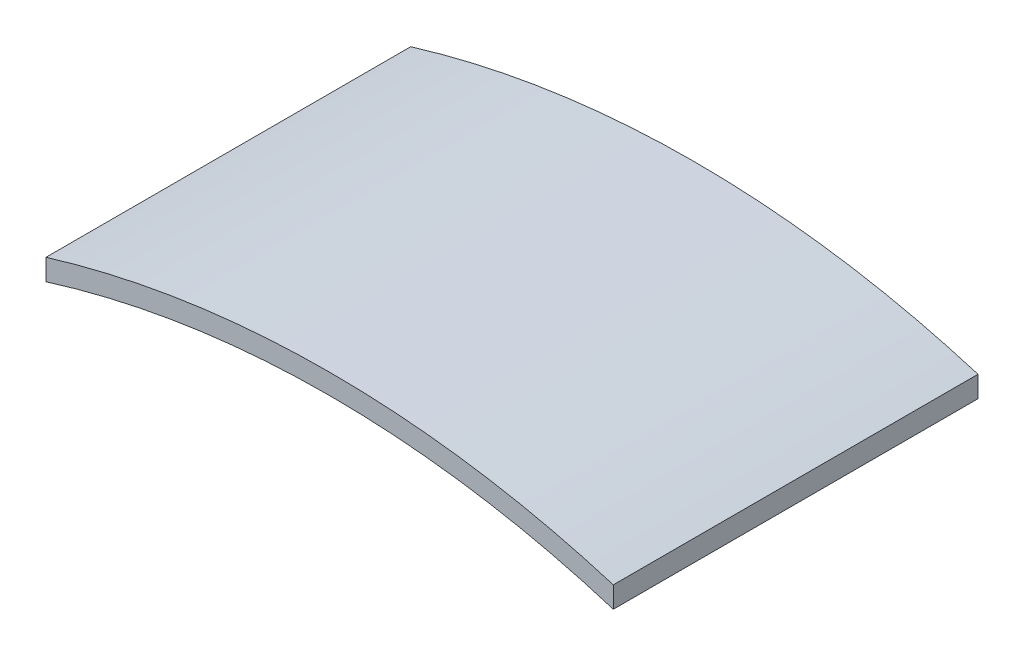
ISO-10303-21;
HEADER;
FILE_DESCRIPTION(('STEP AP214'),'2;1');
FILE_NAME('part.step','',(''),(''),'','','');
FILE_SCHEMA(('AUTOMOTIVE_DESIGN { 1 0 10303 214 1 1 1 1 }'));
ENDSEC;
DATA;
#1=APPLICATION_CONTEXT('core data for automotive mechanical design processes');
#2=APPLICATION_PROTOCOL_DEFINITION('international standard','automotive_design',2000,#1);
#3=PRODUCT_CONTEXT('',#1,'mechanical');
#4=PRODUCT('Part','Part','',(#3));
#5=PRODUCT_RELATED_PRODUCT_CATEGORY('part','',(#4));
#6=PRODUCT_DEFINITION_FORMATION('','',#4);
#7=PRODUCT_DEFINITION_CONTEXT('part definition',#1,'design');
#8=PRODUCT_DEFINITION('design','',#6,#7);
#9=PRODUCT_DEFINITION_SHAPE('','',#8);
#10=(LENGTH_UNIT() NAMED_UNIT(*) SI_UNIT(.MILLI.,.METRE.));
#11=(NAMED_UNIT(*) PLANE_ANGLE_UNIT() SI_UNIT($,.RADIAN.));
#12=(NAMED_UNIT(*) SI_UNIT($,.STERADIAN.) SOLID_ANGLE_UNIT());
#13=UNCERTAINTY_MEASURE_WITH_UNIT(LENGTH_MEASURE(1.E-05),#10,'distance_accuracy_value','');
#14=(GEOMETRIC_REPRESENTATION_CONTEXT(3) GLOBAL_UNCERTAINTY_ASSIGNED_CONTEXT((#13)) GLOBAL_UNIT_ASSIGNED_CONTEXT((#10,
#11,#12)) REPRESENTATION_CONTEXT('',''));
#15=CARTESIAN_POINT('',(0.,0.,0.));
#16=DIRECTION('',(0.,0.,1.));
#17=DIRECTION('',(1.,0.,0.));
#18=AXIS2_PLACEMENT_3D('',#15,#16,#17);
#19=CARTESIAN_POINT('',(0.,0.,28.575));
#20=DIRECTION('',(0.,0.,-1.));
#21=DIRECTION('',(-1.,0.,0.));
#22=AXIS2_PLACEMENT_3D('',#19,#20,#21);
#23=CYLINDRICAL_SURFACE('',#22,76.2);
#24=CARTESIAN_POINT('',(0.,0.,0.));
#25=DIRECTION('',(0.,0.,1.));
#26=DIRECTION('',(1.,0.,0.));
#27=AXIS2_PLACEMENT_3D('',#24,#25,#26);
#28=CIRCLE('',#27,76.2);
#29=CARTESIAN_POINT('',(22.225,72.8868257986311,0.));
#30=VERTEX_POINT('',#29);
#31=CARTESIAN_POINT('',(-22.225,72.8868257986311,0.));
#32=VERTEX_POINT('',#31);
#33=EDGE_CURVE('E94',#30,#32,#28,.T.);
#34=ORIENTED_EDGE('',*,*,#33,.T.);
#35=DIRECTION('',(0.,0.,-1.));
#36=VECTOR('',#35,1.);
#37=CARTESIAN_POINT('',(-22.225,72.8868257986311,28.575));
#38=LINE('',#37,#36);
#39=CARTESIAN_POINT('',(-22.225,72.8868257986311,28.575));
#40=VERTEX_POINT('',#39);
#41=EDGE_CURVE('E11',#40,#32,#38,.T.);
#42=ORIENTED_EDGE('',*,*,#41,.F.);
#43=CARTESIAN_POINT('',(0.,0.,28.575));
#44=DIRECTION('',(0.,0.,1.));
#45=DIRECTION('',(1.,0.,0.));
#46=AXIS2_PLACEMENT_3D('',#43,#44,#45);
#47=CIRCLE('',#46,76.2);
#48=CARTESIAN_POINT('',(22.225,72.8868257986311,28.575));
#49=VERTEX_POINT('',#48);
#50=EDGE_CURVE('E82',#49,#40,#47,.T.);
#51=ORIENTED_EDGE('',*,*,#50,.F.);
#52=DIRECTION('',(0.,0.,-1.));
#53=VECTOR('',#52,1.);
#54=CARTESIAN_POINT('',(22.225,72.8868257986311,28.575));
#55=LINE('',#54,#53);
#56=EDGE_CURVE('E90',#49,#30,#55,.T.);
#57=ORIENTED_EDGE('',*,*,#56,.T.);
#58=EDGE_LOOP('',(#34,#42,#51,#57));
#59=FACE_BOUND('',#58,.T.);
#60=ADVANCED_FACE('F31',(#59),#23,.T.);
#61=CARTESIAN_POINT('',(-22.225,71.2255188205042,28.575));
#62=DIRECTION('',(1.,0.,0.));
#63=DIRECTION('',(0.,0.,-1.));
#64=AXIS2_PLACEMENT_3D('',#61,#62,#63);
#65=PLANE('',#64);
#66=DIRECTION('',(0.,-1.,0.));
#67=VECTOR('',#66,1.);
#68=CARTESIAN_POINT('',(-22.225,71.2255188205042,0.));
#69=LINE('',#68,#67);
#70=CARTESIAN_POINT('',(-22.225,71.2255188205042,0.));
#71=VERTEX_POINT('',#70);
#72=EDGE_CURVE('E86',#32,#71,#69,.T.);
#73=ORIENTED_EDGE('',*,*,#72,.T.);
#74=DIRECTION('',(0.,0.,-1.));
#75=VECTOR('',#74,1.);
#76=CARTESIAN_POINT('',(-22.225,71.2255188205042,28.575));
#77=LINE('',#76,#75);
#78=CARTESIAN_POINT('',(-22.225,71.2255188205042,28.575));
#79=VERTEX_POINT('',#78);
#80=EDGE_CURVE('E39',#79,#71,#77,.T.);
#81=ORIENTED_EDGE('',*,*,#80,.F.);
#82=DIRECTION('',(0.,-1.,0.));
#83=VECTOR('',#82,1.);
#84=CARTESIAN_POINT('',(-22.225,71.2255188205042,28.575));
#85=LINE('',#84,#83);
#86=EDGE_CURVE('E77',#40,#79,#85,.T.);
#87=ORIENTED_EDGE('',*,*,#86,.F.);
#88=ORIENTED_EDGE('',*,*,#41,.T.);
#89=EDGE_LOOP('',(#73,#81,#87,#88));
#90=FACE_BOUND('',#89,.T.);
#91=ADVANCED_FACE('F85',(#90),#65,.F.);
#92=CARTESIAN_POINT('',(0.,0.,28.575));
#93=DIRECTION('',(0.,0.,-1.));
#94=DIRECTION('',(-1.,0.,0.));
#95=AXIS2_PLACEMENT_3D('',#92,#93,#94);
#96=CYLINDRICAL_SURFACE('',#95,74.6125);
#97=CARTESIAN_POINT('',(0.,0.,0.));
#98=DIRECTION('',(0.,0.,-1.));
#99=DIRECTION('',(1.,0.,0.));
#100=AXIS2_PLACEMENT_3D('',#97,#98,#99);
#101=CIRCLE('',#100,74.6125);
#102=CARTESIAN_POINT('',(22.225,71.2255188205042,0.));
#103=VERTEX_POINT('',#102);
#104=EDGE_CURVE('E64',#71,#103,#101,.T.);
#105=ORIENTED_EDGE('',*,*,#104,.T.);
#106=DIRECTION('',(0.,0.,-1.));
#107=VECTOR('',#106,1.);
#108=CARTESIAN_POINT('',(22.225,71.2255188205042,28.575));
#109=LINE('',#108,#107);
#110=CARTESIAN_POINT('',(22.225,71.2255188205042,28.575));
#111=VERTEX_POINT('',#110);
#112=EDGE_CURVE('E87',#111,#103,#109,.T.);
#113=ORIENTED_EDGE('',*,*,#112,.F.);
#114=CARTESIAN_POINT('',(0.,0.,28.575));
#115=DIRECTION('',(0.,0.,-1.));
#116=DIRECTION('',(1.,0.,0.));
#117=AXIS2_PLACEMENT_3D('',#114,#115,#116);
#118=CIRCLE('',#117,74.6125);
#119=EDGE_CURVE('E80',#79,#111,#118,.T.);
#120=ORIENTED_EDGE('',*,*,#119,.F.);
#121=ORIENTED_EDGE('',*,*,#80,.T.);
#122=EDGE_LOOP('',(#105,#113,#120,#121));
#123=FACE_BOUND('',#122,.T.);
#124=ADVANCED_FACE('F88',(#123),#96,.F.);
#125=CARTESIAN_POINT('',(22.225,71.2255188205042,28.575));
#126=DIRECTION('',(-1.,0.,0.));
#127=DIRECTION('',(0.,0.,1.));
#128=AXIS2_PLACEMENT_3D('',#125,#126,#127);
#129=PLANE('',#128);
#130=DIRECTION('',(0.,1.,0.));
#131=VECTOR('',#130,1.);
#132=CARTESIAN_POINT('',(22.225,71.2255188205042,0.));
#133=LINE('',#132,#131);
#134=EDGE_CURVE('E70',#103,#30,#133,.T.);
#135=ORIENTED_EDGE('',*,*,#134,.T.);
#136=ORIENTED_EDGE('',*,*,#56,.F.);
#137=DIRECTION('',(0.,1.,0.));
#138=VECTOR('',#137,1.);
#139=CARTESIAN_POINT('',(22.225,71.2255188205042,28.575));
#140=LINE('',#139,#138);
#141=EDGE_CURVE('E47',#111,#49,#140,.T.);
#142=ORIENTED_EDGE('',*,*,#141,.F.);
#143=ORIENTED_EDGE('',*,*,#112,.T.);
#144=EDGE_LOOP('',(#135,#136,#142,#143));
#145=FACE_BOUND('',#144,.T.);
#146=ADVANCED_FACE('F101',(#145),#129,.F.);
#147=CARTESIAN_POINT('',(0.,0.,28.575));
#148=DIRECTION('',(0.,0.,1.));
#149=DIRECTION('',(1.,0.,0.));
#150=AXIS2_PLACEMENT_3D('',#147,#148,#149);
#151=PLANE('',#150);
#152=ORIENTED_EDGE('',*,*,#50,.T.);
#153=ORIENTED_EDGE('',*,*,#86,.T.);
#154=ORIENTED_EDGE('',*,*,#119,.T.);
#155=ORIENTED_EDGE('',*,*,#141,.T.);
#156=EDGE_LOOP('',(#152,#153,#154,#155));
#157=FACE_BOUND('',#156,.T.);
#158=ADVANCED_FACE('F78',(#157),#151,.T.);
#159=CARTESIAN_POINT('',(0.,0.,0.));
#160=DIRECTION('',(0.,0.,1.));
#161=DIRECTION('',(1.,0.,0.));
#162=AXIS2_PLACEMENT_3D('',#159,#160,#161);
#163=PLANE('',#162);
#164=ORIENTED_EDGE('',*,*,#33,.F.);
#165=ORIENTED_EDGE('',*,*,#134,.F.);
#166=ORIENTED_EDGE('',*,*,#104,.F.);
#167=ORIENTED_EDGE('',*,*,#72,.F.);
#168=EDGE_LOOP('',(#164,#165,#166,#167));
#169=FACE_BOUND('',#168,.T.);
#170=ADVANCED_FACE('F104',(#169),#163,.F.);
#171=CLOSED_SHELL('',(#60,#91,#124,#146,#158,#170));
#172=MANIFOLD_SOLID_BREP('B2',#171);
#173=ADVANCED_BREP_SHAPE_REPRESENTATION('',(#18,#172),#14);
#174=SHAPE_DEFINITION_REPRESENTATION(#9,#173);
ENDSEC;
END-ISO-10303-21;
